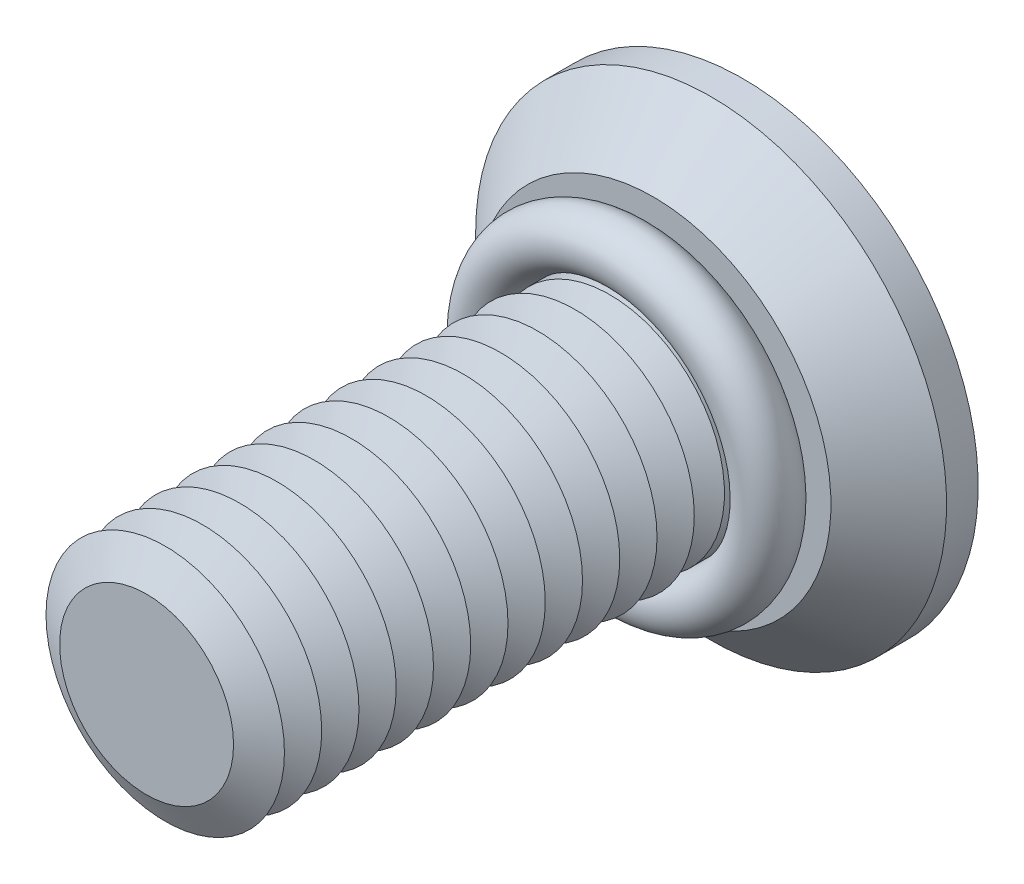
ISO-10303-21;
HEADER;
FILE_DESCRIPTION(('STEP AP214'),'2;1');
FILE_NAME('part.step','',(''),(''),'','','');
FILE_SCHEMA(('AUTOMOTIVE_DESIGN { 1 0 10303 214 1 1 1 1 }'));
ENDSEC;
DATA;
#1=APPLICATION_CONTEXT('core data for automotive mechanical design processes');
#2=APPLICATION_PROTOCOL_DEFINITION('international standard','automotive_design',2000,#1);
#3=PRODUCT_CONTEXT('',#1,'mechanical');
#4=PRODUCT('Part','Part','',(#3));
#5=PRODUCT_RELATED_PRODUCT_CATEGORY('part','',(#4));
#6=PRODUCT_DEFINITION_FORMATION('','',#4);
#7=PRODUCT_DEFINITION_CONTEXT('part definition',#1,'design');
#8=PRODUCT_DEFINITION('design','',#6,#7);
#9=PRODUCT_DEFINITION_SHAPE('','',#8);
#10=(LENGTH_UNIT() NAMED_UNIT(*) SI_UNIT(.MILLI.,.METRE.));
#11=(NAMED_UNIT(*) PLANE_ANGLE_UNIT() SI_UNIT($,.RADIAN.));
#12=(NAMED_UNIT(*) SI_UNIT($,.STERADIAN.) SOLID_ANGLE_UNIT());
#13=UNCERTAINTY_MEASURE_WITH_UNIT(LENGTH_MEASURE(1.E-05),#10,'distance_accuracy_value','');
#14=(GEOMETRIC_REPRESENTATION_CONTEXT(3) GLOBAL_UNCERTAINTY_ASSIGNED_CONTEXT((#13)) GLOBAL_UNIT_ASSIGNED_CONTEXT((#10,
#11,#12)) REPRESENTATION_CONTEXT('',''));
#15=CARTESIAN_POINT('',(0.,0.,0.));
#16=DIRECTION('',(0.,0.,1.));
#17=DIRECTION('',(1.,0.,0.));
#18=AXIS2_PLACEMENT_3D('',#15,#16,#17);
#19=CARTESIAN_POINT('',(0.,0.,3.9));
#20=DIRECTION('',(0.,0.,1.));
#21=DIRECTION('',(1.,0.,0.));
#22=AXIS2_PLACEMENT_3D('',#19,#20,#21);
#23=TOROIDAL_SURFACE('',#22,4.75,0.9);
#24=CARTESIAN_POINT('',(0.,4.75,3.9));
#25=DIRECTION('',(1.,0.,0.));
#26=DIRECTION('',(0.,0.,-1.));
#27=AXIS2_PLACEMENT_3D('',#24,#25,#26);
#28=CIRCLE('',#27,0.9);
#29=CARTESIAN_POINT('',(0.,5.65,3.9));
#30=VERTEX_POINT('',#29);
#31=EDGE_CURVE('P0_E10',#30,#30,#28,.T.);
#32=CARTESIAN_POINT('',(0.,0.,3.9));
#33=DIRECTION('',(0.,0.,1.));
#34=DIRECTION('',(1.,0.,0.));
#35=AXIS2_PLACEMENT_3D('',#32,#33,#34);
#36=CIRCLE('',#35,5.65);
#37=EDGE_CURVE('',#30,#30,#36,.T.);
#38=ORIENTED_EDGE('',*,*,#31,.F.);
#39=ORIENTED_EDGE('',*,*,#31,.T.);
#40=ORIENTED_EDGE('',*,*,#37,.T.);
#41=ORIENTED_EDGE('',*,*,#37,.F.);
#42=EDGE_LOOP('',(#38,#40,#39,#41));
#43=FACE_BOUND('',#42,.T.);
#44=ADVANCED_FACE('P0_F14',(#43),#23,.T.);
#45=CLOSED_SHELL('',(#44));
#46=MANIFOLD_SOLID_BREP('P0_B1',#45);
#47=CARTESIAN_POINT('',(0.,0.,13.75));
#48=DIRECTION('',(0.,0.,-1.));
#49=DIRECTION('',(-1.,0.,0.));
#50=AXIS2_PLACEMENT_3D('',#47,#48,#49);
#51=CONICAL_SURFACE('',#50,2.91746824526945,1.0471975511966);
#52=CARTESIAN_POINT('',(0.,0.,13.125));
#53=DIRECTION('',(0.,0.,1.));
#54=DIRECTION('',(1.,0.,0.));
#55=AXIS2_PLACEMENT_3D('',#52,#53,#54);
#56=CIRCLE('',#55,4.);
#57=CARTESIAN_POINT('',(4.,0.,13.125));
#58=VERTEX_POINT('',#57);
#59=EDGE_CURVE('P1_E324',#58,#58,#56,.T.);
#60=ORIENTED_EDGE('',*,*,#59,.T.);
#61=EDGE_LOOP('',(#60));
#62=FACE_BOUND('',#61,.T.);
#63=CARTESIAN_POINT('',(0.,0.,13.75));
#64=DIRECTION('',(0.,0.,1.));
#65=DIRECTION('',(1.,0.,0.));
#66=AXIS2_PLACEMENT_3D('',#63,#64,#65);
#67=CIRCLE('',#66,2.91746824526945);
#68=CARTESIAN_POINT('',(2.91746824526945,0.,13.75));
#69=VERTEX_POINT('',#68);
#70=EDGE_CURVE('P1_E321',#69,#69,#67,.T.);
#71=ORIENTED_EDGE('',*,*,#70,.F.);
#72=EDGE_LOOP('',(#71));
#73=FACE_BOUND('',#72,.T.);
#74=ADVANCED_FACE('P1_F15',(#62,#73),#51,.T.);
#75=CARTESIAN_POINT('',(0.,0.,14.375));
#76=DIRECTION('',(0.,0.,1.));
#77=DIRECTION('',(1.,0.,0.));
#78=AXIS2_PLACEMENT_3D('',#75,#76,#77);
#79=CONICAL_SURFACE('',#78,4.,1.0471975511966);
#80=ORIENTED_EDGE('',*,*,#70,.T.);
#81=EDGE_LOOP('',(#80));
#82=FACE_BOUND('',#81,.T.);
#83=CARTESIAN_POINT('',(0.,0.,14.375));
#84=DIRECTION('',(0.,0.,1.));
#85=DIRECTION('',(1.,0.,0.));
#86=AXIS2_PLACEMENT_3D('',#83,#84,#85);
#87=CIRCLE('',#86,4.);
#88=CARTESIAN_POINT('',(4.,0.,14.375));
#89=VERTEX_POINT('',#88);
#90=EDGE_CURVE('P1_E318',#89,#89,#87,.T.);
#91=ORIENTED_EDGE('',*,*,#90,.F.);
#92=EDGE_LOOP('',(#91));
#93=FACE_BOUND('',#92,.T.);
#94=ADVANCED_FACE('P1_F245',(#82,#93),#79,.T.);
#95=CARTESIAN_POINT('',(0.,0.,20.));
#96=DIRECTION('',(0.,0.,1.));
#97=DIRECTION('',(1.,0.,0.));
#98=AXIS2_PLACEMENT_3D('',#95,#96,#97);
#99=PLANE('',#98);
#100=CARTESIAN_POINT('',(0.,0.,20.));
#101=DIRECTION('',(0.,0.,1.));
#102=DIRECTION('',(1.,0.,0.));
#103=AXIS2_PLACEMENT_3D('',#100,#101,#102);
#104=CIRCLE('',#103,2.91746824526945);
#105=CARTESIAN_POINT('',(2.91746824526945,0.,20.));
#106=VERTEX_POINT('',#105);
#107=EDGE_CURVE('P1_E131',#106,#106,#104,.T.);
#108=ORIENTED_EDGE('',*,*,#107,.T.);
#109=EDGE_LOOP('',(#108));
#110=FACE_BOUND('',#109,.T.);
#111=ADVANCED_FACE('P1_F251',(#110),#99,.T.);
#112=CARTESIAN_POINT('',(0.,0.,20.));
#113=DIRECTION('',(0.,0.,-1.));
#114=DIRECTION('',(-1.,0.,0.));
#115=AXIS2_PLACEMENT_3D('',#112,#113,#114);
#116=CONICAL_SURFACE('',#115,2.91746824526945,1.0471975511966);
#117=CARTESIAN_POINT('',(0.,0.,19.375));
#118=DIRECTION('',(0.,0.,1.));
#119=DIRECTION('',(1.,0.,0.));
#120=AXIS2_PLACEMENT_3D('',#117,#118,#119);
#121=CIRCLE('',#120,4.);
#122=CARTESIAN_POINT('',(4.,0.,19.375));
#123=VERTEX_POINT('',#122);
#124=EDGE_CURVE('P1_E133',#123,#123,#121,.T.);
#125=ORIENTED_EDGE('',*,*,#124,.T.);
#126=EDGE_LOOP('',(#125));
#127=FACE_BOUND('',#126,.T.);
#128=ORIENTED_EDGE('',*,*,#107,.F.);
#129=EDGE_LOOP('',(#128));
#130=FACE_BOUND('',#129,.T.);
#131=ADVANCED_FACE('P1_F196',(#127,#130),#116,.T.);
#132=CARTESIAN_POINT('',(0.,0.,19.375));
#133=DIRECTION('',(0.,0.,1.));
#134=DIRECTION('',(1.,0.,0.));
#135=AXIS2_PLACEMENT_3D('',#132,#133,#134);
#136=CONICAL_SURFACE('',#135,4.,1.0471975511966);
#137=CARTESIAN_POINT('',(0.,0.,18.75));
#138=DIRECTION('',(0.,0.,1.));
#139=DIRECTION('',(1.,0.,0.));
#140=AXIS2_PLACEMENT_3D('',#137,#138,#139);
#141=CIRCLE('',#140,2.91746824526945);
#142=CARTESIAN_POINT('',(2.91746824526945,0.,18.75));
#143=VERTEX_POINT('',#142);
#144=EDGE_CURVE('P1_E297',#143,#143,#141,.T.);
#145=ORIENTED_EDGE('',*,*,#144,.T.);
#146=EDGE_LOOP('',(#145));
#147=FACE_BOUND('',#146,.T.);
#148=ORIENTED_EDGE('',*,*,#124,.F.);
#149=EDGE_LOOP('',(#148));
#150=FACE_BOUND('',#149,.T.);
#151=ADVANCED_FACE('P1_F284',(#147,#150),#136,.T.);
#152=CARTESIAN_POINT('',(0.,0.,18.75));
#153=DIRECTION('',(0.,0.,-1.));
#154=DIRECTION('',(-1.,0.,0.));
#155=AXIS2_PLACEMENT_3D('',#152,#153,#154);
#156=CONICAL_SURFACE('',#155,2.91746824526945,1.0471975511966);
#157=CARTESIAN_POINT('',(0.,0.,18.125));
#158=DIRECTION('',(0.,0.,1.));
#159=DIRECTION('',(1.,0.,0.));
#160=AXIS2_PLACEMENT_3D('',#157,#158,#159);
#161=CIRCLE('',#160,4.);
#162=CARTESIAN_POINT('',(4.,0.,18.125));
#163=VERTEX_POINT('',#162);
#164=EDGE_CURVE('P1_E294',#163,#163,#161,.T.);
#165=ORIENTED_EDGE('',*,*,#164,.T.);
#166=EDGE_LOOP('',(#165));
#167=FACE_BOUND('',#166,.T.);
#168=ORIENTED_EDGE('',*,*,#144,.F.);
#169=EDGE_LOOP('',(#168));
#170=FACE_BOUND('',#169,.T.);
#171=ADVANCED_FACE('P1_F279',(#167,#170),#156,.T.);
#172=CARTESIAN_POINT('',(0.,0.,18.125));
#173=DIRECTION('',(0.,0.,1.));
#174=DIRECTION('',(1.,0.,0.));
#175=AXIS2_PLACEMENT_3D('',#172,#173,#174);
#176=CONICAL_SURFACE('',#175,4.,1.0471975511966);
#177=CARTESIAN_POINT('',(0.,0.,17.5));
#178=DIRECTION('',(0.,0.,1.));
#179=DIRECTION('',(1.,0.,0.));
#180=AXIS2_PLACEMENT_3D('',#177,#178,#179);
#181=CIRCLE('',#180,2.91746824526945);
#182=CARTESIAN_POINT('',(2.91746824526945,0.,17.5));
#183=VERTEX_POINT('',#182);
#184=EDGE_CURVE('P1_E301',#183,#183,#181,.T.);
#185=ORIENTED_EDGE('',*,*,#184,.T.);
#186=EDGE_LOOP('',(#185));
#187=FACE_BOUND('',#186,.T.);
#188=ORIENTED_EDGE('',*,*,#164,.F.);
#189=EDGE_LOOP('',(#188));
#190=FACE_BOUND('',#189,.T.);
#191=ADVANCED_FACE('P1_F276',(#187,#190),#176,.T.);
#192=CARTESIAN_POINT('',(0.,0.,17.5));
#193=DIRECTION('',(0.,0.,-1.));
#194=DIRECTION('',(-1.,0.,0.));
#195=AXIS2_PLACEMENT_3D('',#192,#193,#194);
#196=CONICAL_SURFACE('',#195,2.91746824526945,1.0471975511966);
#197=CARTESIAN_POINT('',(0.,0.,16.875));
#198=DIRECTION('',(0.,0.,1.));
#199=DIRECTION('',(1.,0.,0.));
#200=AXIS2_PLACEMENT_3D('',#197,#198,#199);
#201=CIRCLE('',#200,4.);
#202=CARTESIAN_POINT('',(4.,0.,16.875));
#203=VERTEX_POINT('',#202);
#204=EDGE_CURVE('P1_E306',#203,#203,#201,.T.);
#205=ORIENTED_EDGE('',*,*,#204,.T.);
#206=EDGE_LOOP('',(#205));
#207=FACE_BOUND('',#206,.T.);
#208=ORIENTED_EDGE('',*,*,#184,.F.);
#209=EDGE_LOOP('',(#208));
#210=FACE_BOUND('',#209,.T.);
#211=ADVANCED_FACE('P1_F271',(#207,#210),#196,.T.);
#212=CARTESIAN_POINT('',(0.,0.,16.875));
#213=DIRECTION('',(0.,0.,1.));
#214=DIRECTION('',(1.,0.,0.));
#215=AXIS2_PLACEMENT_3D('',#212,#213,#214);
#216=CONICAL_SURFACE('',#215,4.,1.0471975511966);
#217=CARTESIAN_POINT('',(0.,0.,16.25));
#218=DIRECTION('',(0.,0.,1.));
#219=DIRECTION('',(1.,0.,0.));
#220=AXIS2_PLACEMENT_3D('',#217,#218,#219);
#221=CIRCLE('',#220,2.91746824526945);
#222=CARTESIAN_POINT('',(2.91746824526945,0.,16.25));
#223=VERTEX_POINT('',#222);
#224=EDGE_CURVE('P1_E309',#223,#223,#221,.T.);
#225=ORIENTED_EDGE('',*,*,#224,.T.);
#226=EDGE_LOOP('',(#225));
#227=FACE_BOUND('',#226,.T.);
#228=ORIENTED_EDGE('',*,*,#204,.F.);
#229=EDGE_LOOP('',(#228));
#230=FACE_BOUND('',#229,.T.);
#231=ADVANCED_FACE('P1_F268',(#227,#230),#216,.T.);
#232=CARTESIAN_POINT('',(0.,0.,16.25));
#233=DIRECTION('',(0.,0.,-1.));
#234=DIRECTION('',(-1.,0.,0.));
#235=AXIS2_PLACEMENT_3D('',#232,#233,#234);
#236=CONICAL_SURFACE('',#235,2.91746824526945,1.0471975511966);
#237=CARTESIAN_POINT('',(0.,0.,15.625));
#238=DIRECTION('',(0.,0.,1.));
#239=DIRECTION('',(1.,0.,0.));
#240=AXIS2_PLACEMENT_3D('',#237,#238,#239);
#241=CIRCLE('',#240,4.);
#242=CARTESIAN_POINT('',(4.,0.,15.625));
#243=VERTEX_POINT('',#242);
#244=EDGE_CURVE('P1_E312',#243,#243,#241,.T.);
#245=ORIENTED_EDGE('',*,*,#244,.T.);
#246=EDGE_LOOP('',(#245));
#247=FACE_BOUND('',#246,.T.);
#248=ORIENTED_EDGE('',*,*,#224,.F.);
#249=EDGE_LOOP('',(#248));
#250=FACE_BOUND('',#249,.T.);
#251=ADVANCED_FACE('P1_F262',(#247,#250),#236,.T.);
#252=CARTESIAN_POINT('',(0.,0.,15.625));
#253=DIRECTION('',(0.,0.,1.));
#254=DIRECTION('',(1.,0.,0.));
#255=AXIS2_PLACEMENT_3D('',#252,#253,#254);
#256=CONICAL_SURFACE('',#255,4.,1.0471975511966);
#257=CARTESIAN_POINT('',(0.,0.,15.));
#258=DIRECTION('',(0.,0.,1.));
#259=DIRECTION('',(1.,0.,0.));
#260=AXIS2_PLACEMENT_3D('',#257,#258,#259);
#261=CIRCLE('',#260,2.91746824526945);
#262=CARTESIAN_POINT('',(2.91746824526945,0.,15.));
#263=VERTEX_POINT('',#262);
#264=EDGE_CURVE('P1_E315',#263,#263,#261,.T.);
#265=ORIENTED_EDGE('',*,*,#264,.T.);
#266=EDGE_LOOP('',(#265));
#267=FACE_BOUND('',#266,.T.);
#268=ORIENTED_EDGE('',*,*,#244,.F.);
#269=EDGE_LOOP('',(#268));
#270=FACE_BOUND('',#269,.T.);
#271=ADVANCED_FACE('P1_F258',(#267,#270),#256,.T.);
#272=CARTESIAN_POINT('',(0.,0.,15.));
#273=DIRECTION('',(0.,0.,-1.));
#274=DIRECTION('',(-1.,0.,0.));
#275=AXIS2_PLACEMENT_3D('',#272,#273,#274);
#276=CONICAL_SURFACE('',#275,2.91746824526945,1.0471975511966);
#277=ORIENTED_EDGE('',*,*,#90,.T.);
#278=EDGE_LOOP('',(#277));
#279=FACE_BOUND('',#278,.T.);
#280=ORIENTED_EDGE('',*,*,#264,.F.);
#281=EDGE_LOOP('',(#280));
#282=FACE_BOUND('',#281,.T.);
#283=ADVANCED_FACE('P1_F261',(#279,#282),#276,.T.);
#284=CARTESIAN_POINT('',(0.,0.,12.5));
#285=DIRECTION('',(0.,0.,-1.));
#286=DIRECTION('',(-1.,0.,0.));
#287=AXIS2_PLACEMENT_3D('',#284,#285,#286);
#288=CONICAL_SURFACE('',#287,2.91746824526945,1.0471975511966);
#289=CARTESIAN_POINT('',(0.,0.,11.875));
#290=DIRECTION('',(0.,0.,1.));
#291=DIRECTION('',(1.,0.,0.));
#292=AXIS2_PLACEMENT_3D('',#289,#290,#291);
#293=CIRCLE('',#292,4.);
#294=CARTESIAN_POINT('',(4.,0.,11.875));
#295=VERTEX_POINT('',#294);
#296=EDGE_CURVE('P1_E329',#295,#295,#293,.T.);
#297=ORIENTED_EDGE('',*,*,#296,.T.);
#298=EDGE_LOOP('',(#297));
#299=FACE_BOUND('',#298,.T.);
#300=CARTESIAN_POINT('',(0.,0.,12.5));
#301=DIRECTION('',(0.,0.,1.));
#302=DIRECTION('',(1.,0.,0.));
#303=AXIS2_PLACEMENT_3D('',#300,#301,#302);
#304=CIRCLE('',#303,2.91746824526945);
#305=CARTESIAN_POINT('',(2.91746824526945,0.,12.5));
#306=VERTEX_POINT('',#305);
#307=EDGE_CURVE('P1_E326',#306,#306,#304,.T.);
#308=ORIENTED_EDGE('',*,*,#307,.F.);
#309=EDGE_LOOP('',(#308));
#310=FACE_BOUND('',#309,.T.);
#311=ADVANCED_FACE('P1_F266',(#299,#310),#288,.T.);
#312=CARTESIAN_POINT('',(0.,0.,13.125));
#313=DIRECTION('',(0.,0.,1.));
#314=DIRECTION('',(1.,0.,0.));
#315=AXIS2_PLACEMENT_3D('',#312,#313,#314);
#316=CONICAL_SURFACE('',#315,4.,1.0471975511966);
#317=ORIENTED_EDGE('',*,*,#307,.T.);
#318=EDGE_LOOP('',(#317));
#319=FACE_BOUND('',#318,.T.);
#320=ORIENTED_EDGE('',*,*,#59,.F.);
#321=EDGE_LOOP('',(#320));
#322=FACE_BOUND('',#321,.T.);
#323=ADVANCED_FACE('P1_F467',(#319,#322),#316,.T.);
#324=CARTESIAN_POINT('',(0.,0.,11.25));
#325=DIRECTION('',(0.,0.,-1.));
#326=DIRECTION('',(-1.,0.,0.));
#327=AXIS2_PLACEMENT_3D('',#324,#325,#326);
#328=CONICAL_SURFACE('',#327,2.91746824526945,1.0471975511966);
#329=CARTESIAN_POINT('',(0.,0.,10.625));
#330=DIRECTION('',(0.,0.,1.));
#331=DIRECTION('',(1.,0.,0.));
#332=AXIS2_PLACEMENT_3D('',#329,#330,#331);
#333=CIRCLE('',#332,4.);
#334=CARTESIAN_POINT('',(4.,0.,10.625));
#335=VERTEX_POINT('',#334);
#336=EDGE_CURVE('P1_E335',#335,#335,#333,.T.);
#337=ORIENTED_EDGE('',*,*,#336,.T.);
#338=EDGE_LOOP('',(#337));
#339=FACE_BOUND('',#338,.T.);
#340=CARTESIAN_POINT('',(0.,0.,11.25));
#341=DIRECTION('',(0.,0.,1.));
#342=DIRECTION('',(1.,0.,0.));
#343=AXIS2_PLACEMENT_3D('',#340,#341,#342);
#344=CIRCLE('',#343,2.91746824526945);
#345=CARTESIAN_POINT('',(2.91746824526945,0.,11.25));
#346=VERTEX_POINT('',#345);
#347=EDGE_CURVE('P1_E332',#346,#346,#344,.T.);
#348=ORIENTED_EDGE('',*,*,#347,.F.);
#349=EDGE_LOOP('',(#348));
#350=FACE_BOUND('',#349,.T.);
#351=ADVANCED_FACE('P1_F476',(#339,#350),#328,.T.);
#352=CARTESIAN_POINT('',(0.,0.,11.875));
#353=DIRECTION('',(0.,0.,1.));
#354=DIRECTION('',(1.,0.,0.));
#355=AXIS2_PLACEMENT_3D('',#352,#353,#354);
#356=CONICAL_SURFACE('',#355,4.,1.0471975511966);
#357=ORIENTED_EDGE('',*,*,#347,.T.);
#358=EDGE_LOOP('',(#357));
#359=FACE_BOUND('',#358,.T.);
#360=ORIENTED_EDGE('',*,*,#296,.F.);
#361=EDGE_LOOP('',(#360));
#362=FACE_BOUND('',#361,.T.);
#363=ADVANCED_FACE('P1_F486',(#359,#362),#356,.T.);
#364=CARTESIAN_POINT('',(0.,0.,10.));
#365=DIRECTION('',(0.,0.,-1.));
#366=DIRECTION('',(-1.,0.,0.));
#367=AXIS2_PLACEMENT_3D('',#364,#365,#366);
#368=CONICAL_SURFACE('',#367,2.91746824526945,1.0471975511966);
#369=CARTESIAN_POINT('',(0.,0.,9.375));
#370=DIRECTION('',(0.,0.,1.));
#371=DIRECTION('',(1.,0.,0.));
#372=AXIS2_PLACEMENT_3D('',#369,#370,#371);
#373=CIRCLE('',#372,4.);
#374=CARTESIAN_POINT('',(4.,0.,9.375));
#375=VERTEX_POINT('',#374);
#376=EDGE_CURVE('P1_E341',#375,#375,#373,.T.);
#377=ORIENTED_EDGE('',*,*,#376,.T.);
#378=EDGE_LOOP('',(#377));
#379=FACE_BOUND('',#378,.T.);
#380=CARTESIAN_POINT('',(0.,0.,10.));
#381=DIRECTION('',(0.,0.,1.));
#382=DIRECTION('',(1.,0.,0.));
#383=AXIS2_PLACEMENT_3D('',#380,#381,#382);
#384=CIRCLE('',#383,2.91746824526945);
#385=CARTESIAN_POINT('',(2.91746824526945,0.,10.));
#386=VERTEX_POINT('',#385);
#387=EDGE_CURVE('P1_E338',#386,#386,#384,.T.);
#388=ORIENTED_EDGE('',*,*,#387,.F.);
#389=EDGE_LOOP('',(#388));
#390=FACE_BOUND('',#389,.T.);
#391=ADVANCED_FACE('P1_F496',(#379,#390),#368,.T.);
#392=CARTESIAN_POINT('',(0.,0.,10.625));
#393=DIRECTION('',(0.,0.,1.));
#394=DIRECTION('',(1.,0.,0.));
#395=AXIS2_PLACEMENT_3D('',#392,#393,#394);
#396=CONICAL_SURFACE('',#395,4.,1.0471975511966);
#397=ORIENTED_EDGE('',*,*,#387,.T.);
#398=EDGE_LOOP('',(#397));
#399=FACE_BOUND('',#398,.T.);
#400=ORIENTED_EDGE('',*,*,#336,.F.);
#401=EDGE_LOOP('',(#400));
#402=FACE_BOUND('',#401,.T.);
#403=ADVANCED_FACE('P1_F506',(#399,#402),#396,.T.);
#404=CARTESIAN_POINT('',(0.,0.,8.75));
#405=DIRECTION('',(0.,0.,-1.));
#406=DIRECTION('',(-1.,0.,0.));
#407=AXIS2_PLACEMENT_3D('',#404,#405,#406);
#408=CONICAL_SURFACE('',#407,2.91746824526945,1.0471975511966);
#409=CARTESIAN_POINT('',(0.,0.,8.125));
#410=DIRECTION('',(0.,0.,1.));
#411=DIRECTION('',(1.,0.,0.));
#412=AXIS2_PLACEMENT_3D('',#409,#410,#411);
#413=CIRCLE('',#412,4.);
#414=CARTESIAN_POINT('',(4.,0.,8.125));
#415=VERTEX_POINT('',#414);
#416=EDGE_CURVE('P1_E347',#415,#415,#413,.T.);
#417=ORIENTED_EDGE('',*,*,#416,.T.);
#418=EDGE_LOOP('',(#417));
#419=FACE_BOUND('',#418,.T.);
#420=CARTESIAN_POINT('',(0.,0.,8.75));
#421=DIRECTION('',(0.,0.,1.));
#422=DIRECTION('',(1.,0.,0.));
#423=AXIS2_PLACEMENT_3D('',#420,#421,#422);
#424=CIRCLE('',#423,2.91746824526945);
#425=CARTESIAN_POINT('',(2.91746824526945,0.,8.75));
#426=VERTEX_POINT('',#425);
#427=EDGE_CURVE('P1_E344',#426,#426,#424,.T.);
#428=ORIENTED_EDGE('',*,*,#427,.F.);
#429=EDGE_LOOP('',(#428));
#430=FACE_BOUND('',#429,.T.);
#431=ADVANCED_FACE('P1_F516',(#419,#430),#408,.T.);
#432=CARTESIAN_POINT('',(0.,0.,9.375));
#433=DIRECTION('',(0.,0.,1.));
#434=DIRECTION('',(1.,0.,0.));
#435=AXIS2_PLACEMENT_3D('',#432,#433,#434);
#436=CONICAL_SURFACE('',#435,4.,1.0471975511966);
#437=ORIENTED_EDGE('',*,*,#427,.T.);
#438=EDGE_LOOP('',(#437));
#439=FACE_BOUND('',#438,.T.);
#440=ORIENTED_EDGE('',*,*,#376,.F.);
#441=EDGE_LOOP('',(#440));
#442=FACE_BOUND('',#441,.T.);
#443=ADVANCED_FACE('P1_F526',(#439,#442),#436,.T.);
#444=CARTESIAN_POINT('',(0.,0.,7.5));
#445=DIRECTION('',(0.,0.,-1.));
#446=DIRECTION('',(-1.,0.,0.));
#447=AXIS2_PLACEMENT_3D('',#444,#445,#446);
#448=CONICAL_SURFACE('',#447,2.91746824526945,1.0471975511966);
#449=CARTESIAN_POINT('',(0.,0.,6.875));
#450=DIRECTION('',(0.,0.,1.));
#451=DIRECTION('',(1.,0.,0.));
#452=AXIS2_PLACEMENT_3D('',#449,#450,#451);
#453=CIRCLE('',#452,4.);
#454=CARTESIAN_POINT('',(4.,0.,6.875));
#455=VERTEX_POINT('',#454);
#456=EDGE_CURVE('P1_E353',#455,#455,#453,.T.);
#457=ORIENTED_EDGE('',*,*,#456,.T.);
#458=EDGE_LOOP('',(#457));
#459=FACE_BOUND('',#458,.T.);
#460=CARTESIAN_POINT('',(0.,0.,7.5));
#461=DIRECTION('',(0.,0.,1.));
#462=DIRECTION('',(1.,0.,0.));
#463=AXIS2_PLACEMENT_3D('',#460,#461,#462);
#464=CIRCLE('',#463,2.91746824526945);
#465=CARTESIAN_POINT('',(2.91746824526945,0.,7.5));
#466=VERTEX_POINT('',#465);
#467=EDGE_CURVE('P1_E350',#466,#466,#464,.T.);
#468=ORIENTED_EDGE('',*,*,#467,.F.);
#469=EDGE_LOOP('',(#468));
#470=FACE_BOUND('',#469,.T.);
#471=ADVANCED_FACE('P1_F536',(#459,#470),#448,.T.);
#472=CARTESIAN_POINT('',(0.,0.,8.125));
#473=DIRECTION('',(0.,0.,1.));
#474=DIRECTION('',(1.,0.,0.));
#475=AXIS2_PLACEMENT_3D('',#472,#473,#474);
#476=CONICAL_SURFACE('',#475,4.,1.0471975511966);
#477=ORIENTED_EDGE('',*,*,#467,.T.);
#478=EDGE_LOOP('',(#477));
#479=FACE_BOUND('',#478,.T.);
#480=ORIENTED_EDGE('',*,*,#416,.F.);
#481=EDGE_LOOP('',(#480));
#482=FACE_BOUND('',#481,.T.);
#483=ADVANCED_FACE('P1_F546',(#479,#482),#476,.T.);
#484=CARTESIAN_POINT('',(0.,0.,6.25));
#485=DIRECTION('',(0.,0.,-1.));
#486=DIRECTION('',(-1.,0.,0.));
#487=AXIS2_PLACEMENT_3D('',#484,#485,#486);
#488=CONICAL_SURFACE('',#487,2.91746824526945,1.0471975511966);
#489=CARTESIAN_POINT('',(0.,0.,5.625));
#490=DIRECTION('',(0.,0.,1.));
#491=DIRECTION('',(1.,0.,0.));
#492=AXIS2_PLACEMENT_3D('',#489,#490,#491);
#493=CIRCLE('',#492,4.);
#494=CARTESIAN_POINT('',(4.,0.,5.625));
#495=VERTEX_POINT('',#494);
#496=EDGE_CURVE('P1_E359',#495,#495,#493,.T.);
#497=ORIENTED_EDGE('',*,*,#496,.T.);
#498=EDGE_LOOP('',(#497));
#499=FACE_BOUND('',#498,.T.);
#500=CARTESIAN_POINT('',(0.,0.,6.25));
#501=DIRECTION('',(0.,0.,1.));
#502=DIRECTION('',(1.,0.,0.));
#503=AXIS2_PLACEMENT_3D('',#500,#501,#502);
#504=CIRCLE('',#503,2.91746824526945);
#505=CARTESIAN_POINT('',(2.91746824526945,0.,6.25));
#506=VERTEX_POINT('',#505);
#507=EDGE_CURVE('P1_E356',#506,#506,#504,.T.);
#508=ORIENTED_EDGE('',*,*,#507,.F.);
#509=EDGE_LOOP('',(#508));
#510=FACE_BOUND('',#509,.T.);
#511=ADVANCED_FACE('P1_F556',(#499,#510),#488,.T.);
#512=CARTESIAN_POINT('',(0.,0.,6.875));
#513=DIRECTION('',(0.,0.,1.));
#514=DIRECTION('',(1.,0.,0.));
#515=AXIS2_PLACEMENT_3D('',#512,#513,#514);
#516=CONICAL_SURFACE('',#515,4.,1.0471975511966);
#517=ORIENTED_EDGE('',*,*,#507,.T.);
#518=EDGE_LOOP('',(#517));
#519=FACE_BOUND('',#518,.T.);
#520=ORIENTED_EDGE('',*,*,#456,.F.);
#521=EDGE_LOOP('',(#520));
#522=FACE_BOUND('',#521,.T.);
#523=ADVANCED_FACE('P1_F372',(#519,#522),#516,.T.);
#524=CARTESIAN_POINT('',(0.,0.,5.));
#525=DIRECTION('',(0.,0.,-1.));
#526=DIRECTION('',(-1.,0.,0.));
#527=AXIS2_PLACEMENT_3D('',#524,#525,#526);
#528=CONICAL_SURFACE('',#527,2.91746824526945,1.0471975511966);
#529=CARTESIAN_POINT('',(0.,0.,5.));
#530=DIRECTION('',(0.,0.,1.));
#531=DIRECTION('',(1.,0.,0.));
#532=AXIS2_PLACEMENT_3D('',#529,#530,#531);
#533=CIRCLE('',#532,2.91746824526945);
#534=CARTESIAN_POINT('',(2.91746824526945,0.,5.));
#535=VERTEX_POINT('',#534);
#536=EDGE_CURVE('P1_E362',#535,#535,#533,.T.);
#537=ORIENTED_EDGE('',*,*,#536,.F.);
#538=EDGE_LOOP('',(#537));
#539=FACE_BOUND('',#538,.T.);
#540=CARTESIAN_POINT('',(0.,0.,4.46160254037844));
#541=DIRECTION('',(0.,0.,-1.));
#542=DIRECTION('',(-1.,0.,0.));
#543=AXIS2_PLACEMENT_3D('',#540,#541,#542);
#544=CIRCLE('',#543,3.85);
#545=CARTESIAN_POINT('',(-3.85,0.,4.46160254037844));
#546=VERTEX_POINT('',#545);
#547=EDGE_CURVE('P1_E19',#546,#546,#544,.F.);
#548=ORIENTED_EDGE('',*,*,#547,.T.);
#549=EDGE_LOOP('',(#548));
#550=FACE_BOUND('',#549,.T.);
#551=ADVANCED_FACE('P1_F369',(#539,#550),#528,.T.);
#552=CARTESIAN_POINT('',(0.,0.,5.625));
#553=DIRECTION('',(0.,0.,1.));
#554=DIRECTION('',(1.,0.,0.));
#555=AXIS2_PLACEMENT_3D('',#552,#553,#554);
#556=CONICAL_SURFACE('',#555,4.,1.0471975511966);
#557=ORIENTED_EDGE('',*,*,#536,.T.);
#558=EDGE_LOOP('',(#557));
#559=FACE_BOUND('',#558,.T.);
#560=ORIENTED_EDGE('',*,*,#496,.F.);
#561=EDGE_LOOP('',(#560));
#562=FACE_BOUND('',#561,.T.);
#563=ADVANCED_FACE('P1_F366',(#559,#562),#556,.T.);
#564=CARTESIAN_POINT('',(0.,0.,3.));
#565=DIRECTION('',(0.,0.,-1.));
#566=DIRECTION('',(-1.,0.,0.));
#567=AXIS2_PLACEMENT_3D('',#564,#565,#566);
#568=CONICAL_SURFACE('',#567,2.5,1.0471975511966);
#569=CARTESIAN_POINT('',(0.,0.,4.44337567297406));
#570=VERTEX_POINT('',#569);
#571=VERTEX_LOOP('',#570);
#572=FACE_BOUND('',#571,.T.);
#573=CARTESIAN_POINT('',(0.,0.,3.));
#574=DIRECTION('',(0.,0.,-1.));
#575=DIRECTION('',(-1.,0.,0.));
#576=AXIS2_PLACEMENT_3D('',#573,#574,#575);
#577=CIRCLE('',#576,2.5);
#578=CARTESIAN_POINT('',(-2.5,0.,3.));
#579=VERTEX_POINT('',#578);
#580=CARTESIAN_POINT('',(-1.25,2.1650635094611,3.));
#581=VERTEX_POINT('',#580);
#582=EDGE_CURVE('P1_E117',#579,#581,#577,.T.);
#583=ORIENTED_EDGE('',*,*,#582,.T.);
#584=CARTESIAN_POINT('',(0.,0.,3.));
#585=DIRECTION('',(0.,0.,-1.));
#586=DIRECTION('',(-1.,0.,0.));
#587=AXIS2_PLACEMENT_3D('',#584,#585,#586);
#588=CIRCLE('',#587,2.5);
#589=CARTESIAN_POINT('',(1.25,2.1650635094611,3.));
#590=VERTEX_POINT('',#589);
#591=EDGE_CURVE('P1_E24',#581,#590,#588,.T.);
#592=ORIENTED_EDGE('',*,*,#591,.T.);
#593=CARTESIAN_POINT('',(2.5,0.,3.));
#594=VERTEX_POINT('',#593);
#595=EDGE_CURVE('P1_E791',#590,#594,#588,.T.);
#596=ORIENTED_EDGE('',*,*,#595,.T.);
#597=CARTESIAN_POINT('',(1.25,-2.1650635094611,3.));
#598=VERTEX_POINT('',#597);
#599=EDGE_CURVE('P1_E784',#594,#598,#588,.T.);
#600=ORIENTED_EDGE('',*,*,#599,.T.);
#601=CARTESIAN_POINT('',(-1.25,-2.1650635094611,3.));
#602=VERTEX_POINT('',#601);
#603=EDGE_CURVE('P1_E182',#598,#602,#588,.T.);
#604=ORIENTED_EDGE('',*,*,#603,.T.);
#605=EDGE_CURVE('P1_E179',#602,#579,#588,.T.);
#606=ORIENTED_EDGE('',*,*,#605,.T.);
#607=EDGE_LOOP('',(#583,#592,#596,#600,#604,#606));
#608=FACE_BOUND('',#607,.T.);
#609=ADVANCED_FACE('P1_F198',(#572,#608),#568,.F.);
#610=CARTESIAN_POINT('',(0.,0.,3.));
#611=DIRECTION('',(0.,0.,-1.));
#612=DIRECTION('',(-1.,0.,0.));
#613=AXIS2_PLACEMENT_3D('',#610,#611,#612);
#614=PLANE('',#613);
#615=ORIENTED_EDGE('',*,*,#603,.F.);
#616=DIRECTION('',(-0.866025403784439,-0.5,0.));
#617=VECTOR('',#616,1.);
#618=CARTESIAN_POINT('',(2.5,-1.44337567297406,3.));
#619=LINE('',#618,#617);
#620=CARTESIAN_POINT('',(0.,-2.88675134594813,3.));
#621=VERTEX_POINT('',#620);
#622=EDGE_CURVE('P1_E800',#598,#621,#619,.T.);
#623=ORIENTED_EDGE('',*,*,#622,.T.);
#624=DIRECTION('',(-0.866025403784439,0.5,0.));
#625=VECTOR('',#624,1.);
#626=CARTESIAN_POINT('',(0.,-2.88675134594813,3.));
#627=LINE('',#626,#625);
#628=EDGE_CURVE('P1_E807',#621,#602,#627,.T.);
#629=ORIENTED_EDGE('',*,*,#628,.T.);
#630=EDGE_LOOP('',(#615,#623,#629));
#631=FACE_BOUND('',#630,.T.);
#632=ADVANCED_FACE('P1_F598',(#631),#614,.T.);
#633=ORIENTED_EDGE('',*,*,#605,.F.);
#634=CARTESIAN_POINT('',(-2.5,-1.44337567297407,3.));
#635=VERTEX_POINT('',#634);
#636=EDGE_CURVE('P1_E810',#602,#635,#627,.T.);
#637=ORIENTED_EDGE('',*,*,#636,.T.);
#638=DIRECTION('',(0.,1.,0.));
#639=VECTOR('',#638,1.);
#640=CARTESIAN_POINT('',(-2.5,-1.44337567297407,3.));
#641=LINE('',#640,#639);
#642=EDGE_CURVE('P1_E123',#635,#579,#641,.T.);
#643=ORIENTED_EDGE('',*,*,#642,.T.);
#644=EDGE_LOOP('',(#633,#637,#643));
#645=FACE_BOUND('',#644,.T.);
#646=ADVANCED_FACE('P1_F231',(#645),#614,.T.);
#647=ORIENTED_EDGE('',*,*,#582,.F.);
#648=CARTESIAN_POINT('',(-2.5,1.44337567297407,3.));
#649=VERTEX_POINT('',#648);
#650=EDGE_CURVE('P1_E812',#579,#649,#641,.T.);
#651=ORIENTED_EDGE('',*,*,#650,.T.);
#652=DIRECTION('',(0.866025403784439,0.5,0.));
#653=VECTOR('',#652,1.);
#654=CARTESIAN_POINT('',(-2.5,1.44337567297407,3.));
#655=LINE('',#654,#653);
#656=EDGE_CURVE('P1_E815',#649,#581,#655,.T.);
#657=ORIENTED_EDGE('',*,*,#656,.T.);
#658=EDGE_LOOP('',(#647,#651,#657));
#659=FACE_BOUND('',#658,.T.);
#660=ADVANCED_FACE('P1_F615',(#659),#614,.T.);
#661=ORIENTED_EDGE('',*,*,#591,.F.);
#662=CARTESIAN_POINT('',(0.,2.88675134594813,3.));
#663=VERTEX_POINT('',#662);
#664=EDGE_CURVE('P1_E814',#581,#663,#655,.T.);
#665=ORIENTED_EDGE('',*,*,#664,.T.);
#666=DIRECTION('',(0.866025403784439,-0.5,0.));
#667=VECTOR('',#666,1.);
#668=CARTESIAN_POINT('',(0.,2.88675134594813,3.));
#669=LINE('',#668,#667);
#670=EDGE_CURVE('P1_E161',#663,#590,#669,.T.);
#671=ORIENTED_EDGE('',*,*,#670,.T.);
#672=EDGE_LOOP('',(#661,#665,#671));
#673=FACE_BOUND('',#672,.T.);
#674=ADVANCED_FACE('P1_F624',(#673),#614,.T.);
#675=ORIENTED_EDGE('',*,*,#595,.F.);
#676=CARTESIAN_POINT('',(2.5,1.44337567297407,3.));
#677=VERTEX_POINT('',#676);
#678=EDGE_CURVE('P1_E799',#590,#677,#669,.T.);
#679=ORIENTED_EDGE('',*,*,#678,.T.);
#680=DIRECTION('',(0.,-1.,0.));
#681=VECTOR('',#680,1.);
#682=CARTESIAN_POINT('',(2.5,1.44337567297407,3.));
#683=LINE('',#682,#681);
#684=EDGE_CURVE('P1_E794',#677,#594,#683,.T.);
#685=ORIENTED_EDGE('',*,*,#684,.T.);
#686=EDGE_LOOP('',(#675,#679,#685));
#687=FACE_BOUND('',#686,.T.);
#688=ADVANCED_FACE('P1_F633',(#687),#614,.T.);
#689=ORIENTED_EDGE('',*,*,#599,.F.);
#690=CARTESIAN_POINT('',(2.5,-1.44337567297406,3.));
#691=VERTEX_POINT('',#690);
#692=EDGE_CURVE('P1_E786',#594,#691,#683,.T.);
#693=ORIENTED_EDGE('',*,*,#692,.T.);
#694=EDGE_CURVE('P1_E125',#691,#598,#619,.T.);
#695=ORIENTED_EDGE('',*,*,#694,.T.);
#696=EDGE_LOOP('',(#689,#693,#695));
#697=FACE_BOUND('',#696,.T.);
#698=ADVANCED_FACE('P1_F229',(#697),#614,.T.);
#699=CARTESIAN_POINT('',(2.5,-1.44337567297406,3.));
#700=DIRECTION('',(0.5,-0.866025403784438,0.));
#701=DIRECTION('',(0.866025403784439,0.5,0.));
#702=AXIS2_PLACEMENT_3D('',#699,#700,#701);
#703=PLANE('',#702);
#704=DIRECTION('',(0.,0.,-1.));
#705=VECTOR('',#704,1.);
#706=CARTESIAN_POINT('',(2.5,-1.44337567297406,3.));
#707=LINE('',#706,#705);
#708=CARTESIAN_POINT('',(2.5,-1.44337567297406,0.));
#709=VERTEX_POINT('',#708);
#710=EDGE_CURVE('P1_E164',#691,#709,#707,.T.);
#711=ORIENTED_EDGE('',*,*,#710,.T.);
#712=CARTESIAN_POINT('',(2.5002,-1.44326020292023,-3.09419640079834E-05));
#713=CARTESIAN_POINT('',(2.3963647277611,-1.50320952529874,0.0160404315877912));
#714=CARTESIAN_POINT('',(2.29234116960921,-1.56326755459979,0.0306306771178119));
#715=CARTESIAN_POINT('',(2.08392662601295,-1.68359574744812,0.0562644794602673));
#716=CARTESIAN_POINT('',(1.97953550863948,-1.7438659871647,0.0673065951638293));
#717=CARTESIAN_POINT('',(1.77101887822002,-1.86425311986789,0.0851994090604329));
#718=CARTESIAN_POINT('',(1.66689477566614,-1.9243691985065,0.0920714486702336));
#719=CARTESIAN_POINT('',(1.45851376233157,-2.04467803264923,0.101286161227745));
#720=CARTESIAN_POINT('',(1.35425688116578,-2.10487077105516,0.10362971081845));
#721=CARTESIAN_POINT('',(1.14574311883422,-2.22525624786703,0.10362971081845));
#722=CARTESIAN_POINT('',(1.04148623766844,-2.28544898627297,0.101286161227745));
#723=CARTESIAN_POINT('',(0.833105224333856,-2.40575782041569,0.0920714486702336));
#724=CARTESIAN_POINT('',(0.728981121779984,-2.4658738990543,0.0851994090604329));
#725=CARTESIAN_POINT('',(0.520464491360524,-2.58626103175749,0.0673065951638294));
#726=CARTESIAN_POINT('',(0.416073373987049,-2.64653127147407,0.0562644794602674));
#727=CARTESIAN_POINT('',(0.207658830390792,-2.7668594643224,0.030630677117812));
#728=CARTESIAN_POINT('',(0.103635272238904,-2.82691749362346,0.0160404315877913));
#729=CARTESIAN_POINT('',(-0.000199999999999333,-2.88686681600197,-3.09419640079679E-05));
#730=B_SPLINE_CURVE_WITH_KNOTS('',3,(#712,#713,#714,#715,#716,#717,#718,#719,#720,#721,#722,
#723,#724,#725,#726,#727,#728,#729),.UNSPECIFIED.,.F.,.F.,(4,2,2,2,2,2,2,2,4),(0.,
0.362931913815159,0.726011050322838,1.08721601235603,1.44835104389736,1.80948607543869,
2.17069103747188,2.53377017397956,2.89670208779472),.UNSPECIFIED.);
#731=CARTESIAN_POINT('',(0.,-2.88675134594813,0.));
#732=VERTEX_POINT('',#731);
#733=EDGE_CURVE('P1_E118',#709,#732,#730,.T.);
#734=ORIENTED_EDGE('',*,*,#733,.T.);
#735=DIRECTION('',(0.,0.,-1.));
#736=VECTOR('',#735,1.);
#737=CARTESIAN_POINT('',(0.,-2.88675134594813,3.));
#738=LINE('',#737,#736);
#739=EDGE_CURVE('P1_E116',#621,#732,#738,.T.);
#740=ORIENTED_EDGE('',*,*,#739,.F.);
#741=ORIENTED_EDGE('',*,*,#622,.F.);
#742=ORIENTED_EDGE('',*,*,#694,.F.);
#743=EDGE_LOOP('',(#711,#734,#740,#741,#742));
#744=FACE_BOUND('',#743,.T.);
#745=ADVANCED_FACE('P1_F226',(#744),#703,.F.);
#746=CARTESIAN_POINT('',(0.,-2.88675134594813,3.));
#747=DIRECTION('',(-0.5,-0.866025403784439,0.));
#748=DIRECTION('',(0.866025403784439,-0.5,0.));
#749=AXIS2_PLACEMENT_3D('',#746,#747,#748);
#750=PLANE('',#749);
#751=ORIENTED_EDGE('',*,*,#739,.T.);
#752=CARTESIAN_POINT('',(0.000200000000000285,-2.88686681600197,-3.09419640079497E-05));
#753=CARTESIAN_POINT('',(-0.103635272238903,-2.82691749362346,0.0160404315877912));
#754=CARTESIAN_POINT('',(-0.207658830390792,-2.7668594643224,0.030630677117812));
#755=CARTESIAN_POINT('',(-0.416073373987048,-2.64653127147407,0.0562644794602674));
#756=CARTESIAN_POINT('',(-0.520464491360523,-2.58626103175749,0.0673065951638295));
#757=CARTESIAN_POINT('',(-0.728981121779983,-2.4658738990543,0.085199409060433));
#758=CARTESIAN_POINT('',(-0.833105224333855,-2.40575782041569,0.0920714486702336));
#759=CARTESIAN_POINT('',(-1.04148623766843,-2.28544898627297,0.101286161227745));
#760=CARTESIAN_POINT('',(-1.14574311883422,-2.22525624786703,0.10362971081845));
#761=CARTESIAN_POINT('',(-1.35425688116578,-2.10487077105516,0.10362971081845));
#762=CARTESIAN_POINT('',(-1.45851376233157,-2.04467803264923,0.101286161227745));
#763=CARTESIAN_POINT('',(-1.66689477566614,-1.9243691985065,0.0920714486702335));
#764=CARTESIAN_POINT('',(-1.77101887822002,-1.86425311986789,0.0851994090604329));
#765=CARTESIAN_POINT('',(-1.97953550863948,-1.74386598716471,0.0673065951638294));
#766=CARTESIAN_POINT('',(-2.08392662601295,-1.68359574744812,0.0562644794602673));
#767=CARTESIAN_POINT('',(-2.29234116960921,-1.56326755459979,0.0306306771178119));
#768=CARTESIAN_POINT('',(-2.3963647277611,-1.50320952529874,0.0160404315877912));
#769=CARTESIAN_POINT('',(-2.5002,-1.44326020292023,-3.09419640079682E-05));
#770=B_SPLINE_CURVE_WITH_KNOTS('',3,(#752,#753,#754,#755,#756,#757,#758,#759,#760,#761,#762,
#763,#764,#765,#766,#767,#768,#769),.UNSPECIFIED.,.F.,.F.,(4,2,2,2,2,2,2,2,4),(0.,
0.362931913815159,0.726011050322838,1.08721601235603,1.44835104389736,1.80948607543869,
2.17069103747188,2.53377017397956,2.89670208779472),.UNSPECIFIED.);
#771=CARTESIAN_POINT('',(-2.5,-1.44337567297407,0.));
#772=VERTEX_POINT('',#771);
#773=EDGE_CURVE('P1_E94',#732,#772,#770,.T.);
#774=ORIENTED_EDGE('',*,*,#773,.T.);
#775=DIRECTION('',(0.,0.,-1.));
#776=VECTOR('',#775,1.);
#777=CARTESIAN_POINT('',(-2.5,-1.44337567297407,3.));
#778=LINE('',#777,#776);
#779=EDGE_CURVE('P1_E112',#635,#772,#778,.T.);
#780=ORIENTED_EDGE('',*,*,#779,.F.);
#781=ORIENTED_EDGE('',*,*,#636,.F.);
#782=ORIENTED_EDGE('',*,*,#628,.F.);
#783=EDGE_LOOP('',(#751,#774,#780,#781,#782));
#784=FACE_BOUND('',#783,.T.);
#785=ADVANCED_FACE('P1_F110',(#784),#750,.F.);
#786=CARTESIAN_POINT('',(-2.5,-1.44337567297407,3.));
#787=DIRECTION('',(-1.,0.,0.));
#788=DIRECTION('',(0.,-1.,0.));
#789=AXIS2_PLACEMENT_3D('',#786,#787,#788);
#790=PLANE('',#789);
#791=ORIENTED_EDGE('',*,*,#779,.T.);
#792=CARTESIAN_POINT('',(-2.5,-3.76800948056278,-0.438146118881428));
#793=CARTESIAN_POINT('',(-2.5,-3.65512241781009,-0.412947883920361));
#794=CARTESIAN_POINT('',(-2.5,-3.54216337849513,-0.388066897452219));
#795=CARTESIAN_POINT('',(-2.5,-3.31606595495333,-0.339109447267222));
#796=CARTESIAN_POINT('',(-2.5,-3.202927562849,-0.315033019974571));
#797=CARTESIAN_POINT('',(-2.5,-2.97632910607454,-0.26783262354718));
#798=CARTESIAN_POINT('',(-2.5,-2.86286882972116,-0.244709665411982));
#799=CARTESIAN_POINT('',(-2.5,-2.63570880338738,-0.199678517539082));
#800=CARTESIAN_POINT('',(-2.5,-2.52200905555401,-0.177770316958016));
#801=CARTESIAN_POINT('',(-2.5,-2.18246936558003,-0.114640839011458));
#802=CARTESIAN_POINT('',(-2.5,-1.95621666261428,-0.0755946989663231));
#803=CARTESIAN_POINT('',(-2.5,-1.50233128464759,-0.00642421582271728));
#804=CARTESIAN_POINT('',(-2.5,-1.27469889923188,0.0237019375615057));
#805=CARTESIAN_POINT('',(-2.5,-0.930935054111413,0.0592624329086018));
#806=CARTESIAN_POINT('',(-2.5,-0.815306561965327,0.0695411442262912));
#807=CARTESIAN_POINT('',(-2.5,-0.58377590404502,0.0862573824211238));
#808=CARTESIAN_POINT('',(-2.5,-0.467873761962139,0.0926952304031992));
#809=CARTESIAN_POINT('',(-2.5,-0.235955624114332,0.101355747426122));
#810=CARTESIAN_POINT('',(-2.5,-0.119939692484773,0.103580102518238));
#811=CARTESIAN_POINT('',(-2.5,0.112094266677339,0.103677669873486));
#812=CARTESIAN_POINT('',(-2.5,0.228112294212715,0.101550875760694));
#813=CARTESIAN_POINT('',(-2.5,0.460464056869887,0.0930637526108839));
#814=CARTESIAN_POINT('',(-2.5,0.576797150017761,0.0866861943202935));
#815=CARTESIAN_POINT('',(-2.5,0.809186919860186,0.0700539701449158));
#816=CARTESIAN_POINT('',(-2.5,0.925243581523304,0.0597990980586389));
#817=CARTESIAN_POINT('',(-2.5,1.15707831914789,0.0359190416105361));
#818=CARTESIAN_POINT('',(-2.5,1.27285617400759,0.0222917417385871));
#819=CARTESIAN_POINT('',(-2.5,1.50403978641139,-0.0077859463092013));
#820=CARTESIAN_POINT('',(-2.5,1.61944554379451,-0.0242363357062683));
#821=CARTESIAN_POINT('',(-2.5,1.97116037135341,-0.0779484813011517));
#822=CARTESIAN_POINT('',(-2.5,2.20690405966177,-0.118894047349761));
#823=CARTESIAN_POINT('',(-2.5,2.67723558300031,-0.206964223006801));
#824=CARTESIAN_POINT('',(-2.5,2.9118232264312,-0.254089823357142));
#825=CARTESIAN_POINT('',(-2.5,3.38022088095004,-0.352353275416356));
#826=CARTESIAN_POINT('',(-2.5,3.61403064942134,-0.40349227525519));
#827=CARTESIAN_POINT('',(-2.5,4.08105387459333,-0.508428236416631));
#828=CARTESIAN_POINT('',(-2.5,4.31426731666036,-0.562225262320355));
#829=CARTESIAN_POINT('',(-2.5,4.77742011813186,-0.670976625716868));
#830=CARTESIAN_POINT('',(-2.5,5.00736469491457,-0.725908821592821));
#831=CARTESIAN_POINT('',(-2.5,5.46695141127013,-0.837043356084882));
#832=CARTESIAN_POINT('',(-2.5,5.69659354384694,-0.893245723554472));
#833=CARTESIAN_POINT('',(-2.5,6.15532898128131,-1.00649703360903));
#834=CARTESIAN_POINT('',(-2.5,6.38442260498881,-1.06354468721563));
#835=CARTESIAN_POINT('',(-2.5,6.84242442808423,-1.17834514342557));
#836=CARTESIAN_POINT('',(-2.5,7.07133263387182,-1.23609792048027));
#837=CARTESIAN_POINT('',(-2.5,7.30017784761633,-1.29409642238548));
#838=B_SPLINE_CURVE_WITH_KNOTS('',3,(#792,#793,#794,#795,#796,#797,#798,#799,#800,#801,#802,
#803,#804,#805,#806,#807,#808,#809,#810,#811,#812,#813,#814,#815,#816,#817,#818,#819,#820,#821,
#822,#823,#824,#825,#826,#827,#828,#829,#830,#831,#832,#833,#834,#835,#836,#837),.UNSPECIFIED.,
.F.,.F.,(4,2,2,2,2,2,2,2,2,2,2,2,2,2,2,2,2,2,2,2,2,2,4),(0.,0.346996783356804,0.694009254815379,
1.04138068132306,1.38874900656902,2.07743762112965,2.76598637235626,3.11418615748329,
3.46235682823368,3.81038814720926,4.15841997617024,4.50787110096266,4.85734081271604,
5.20703030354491,5.55671994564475,6.27438533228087,6.99216591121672,7.71015258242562,
8.42815670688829,9.13739674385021,9.84665290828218,10.5549206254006,11.2631627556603),.UNSPECIFIED.);
#839=CARTESIAN_POINT('',(-2.5,1.44337567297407,0.));
#840=VERTEX_POINT('',#839);
#841=EDGE_CURVE('P1_E10',#772,#840,#838,.T.);
#842=ORIENTED_EDGE('',*,*,#841,.T.);
#843=DIRECTION('',(0.,0.,-1.));
#844=VECTOR('',#843,1.);
#845=CARTESIAN_POINT('',(-2.5,1.44337567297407,3.));
#846=LINE('',#845,#844);
#847=EDGE_CURVE('P1_E124',#649,#840,#846,.T.);
#848=ORIENTED_EDGE('',*,*,#847,.F.);
#849=ORIENTED_EDGE('',*,*,#650,.F.);
#850=ORIENTED_EDGE('',*,*,#642,.F.);
#851=EDGE_LOOP('',(#791,#842,#848,#849,#850));
#852=FACE_BOUND('',#851,.T.);
#853=ADVANCED_FACE('P1_F120',(#852),#790,.F.);
#854=CARTESIAN_POINT('',(-2.5,1.44337567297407,3.));
#855=DIRECTION('',(-0.5,0.866025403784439,0.));
#856=DIRECTION('',(-0.866025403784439,-0.5,0.));
#857=AXIS2_PLACEMENT_3D('',#854,#855,#856);
#858=PLANE('',#857);
#859=ORIENTED_EDGE('',*,*,#847,.T.);
#860=CARTESIAN_POINT('',(-2.5002,1.44326020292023,-3.09419640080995E-05));
#861=CARTESIAN_POINT('',(-2.3963647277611,1.50320952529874,0.0160404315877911));
#862=CARTESIAN_POINT('',(-2.29234116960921,1.56326755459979,0.0306306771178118));
#863=CARTESIAN_POINT('',(-2.08392662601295,1.68359574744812,0.0562644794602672));
#864=CARTESIAN_POINT('',(-1.97953550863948,1.74386598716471,0.0673065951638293));
#865=CARTESIAN_POINT('',(-1.77101887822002,1.86425311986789,0.0851994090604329));
#866=CARTESIAN_POINT('',(-1.66689477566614,1.9243691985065,0.0920714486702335));
#867=CARTESIAN_POINT('',(-1.45851376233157,2.04467803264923,0.101286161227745));
#868=CARTESIAN_POINT('',(-1.35425688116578,2.10487077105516,0.10362971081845));
#869=CARTESIAN_POINT('',(-1.14574311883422,2.22525624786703,0.10362971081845));
#870=CARTESIAN_POINT('',(-1.04148623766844,2.28544898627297,0.101286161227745));
#871=CARTESIAN_POINT('',(-0.833105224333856,2.40575782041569,0.0920714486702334));
#872=CARTESIAN_POINT('',(-0.728981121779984,2.4658738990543,0.0851994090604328));
#873=CARTESIAN_POINT('',(-0.520464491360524,2.58626103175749,0.0673065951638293));
#874=CARTESIAN_POINT('',(-0.416073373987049,2.64653127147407,0.0562644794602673));
#875=CARTESIAN_POINT('',(-0.207658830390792,2.7668594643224,0.0306306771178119));
#876=CARTESIAN_POINT('',(-0.103635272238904,2.82691749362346,0.0160404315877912));
#877=CARTESIAN_POINT('',(0.000199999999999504,2.88686681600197,-3.09419640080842E-05));
#878=B_SPLINE_CURVE_WITH_KNOTS('',3,(#860,#861,#862,#863,#864,#865,#866,#867,#868,#869,#870,
#871,#872,#873,#874,#875,#876,#877),.UNSPECIFIED.,.F.,.F.,(4,2,2,2,2,2,2,2,4),(0.,
0.362931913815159,0.726011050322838,1.08721601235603,1.44835104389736,1.80948607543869,
2.17069103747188,2.53377017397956,2.89670208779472),.UNSPECIFIED.);
#879=CARTESIAN_POINT('',(0.,2.88675134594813,0.));
#880=VERTEX_POINT('',#879);
#881=EDGE_CURVE('P1_E136',#840,#880,#878,.T.);
#882=ORIENTED_EDGE('',*,*,#881,.T.);
#883=DIRECTION('',(0.,0.,-1.));
#884=VECTOR('',#883,1.);
#885=CARTESIAN_POINT('',(0.,2.88675134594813,3.));
#886=LINE('',#885,#884);
#887=EDGE_CURVE('P1_E155',#663,#880,#886,.T.);
#888=ORIENTED_EDGE('',*,*,#887,.F.);
#889=ORIENTED_EDGE('',*,*,#664,.F.);
#890=ORIENTED_EDGE('',*,*,#656,.F.);
#891=EDGE_LOOP('',(#859,#882,#888,#889,#890));
#892=FACE_BOUND('',#891,.T.);
#893=ADVANCED_FACE('P1_F153',(#892),#858,.F.);
#894=CARTESIAN_POINT('',(0.,2.88675134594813,3.));
#895=DIRECTION('',(0.5,0.866025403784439,0.));
#896=DIRECTION('',(-0.866025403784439,0.5,0.));
#897=AXIS2_PLACEMENT_3D('',#894,#895,#896);
#898=PLANE('',#897);
#899=ORIENTED_EDGE('',*,*,#887,.T.);
#900=CARTESIAN_POINT('',(-0.000200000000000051,2.88686681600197,-3.09419640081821E-05));
#901=CARTESIAN_POINT('',(0.103635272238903,2.82691749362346,0.0160404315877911));
#902=CARTESIAN_POINT('',(0.207658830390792,2.7668594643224,0.0306306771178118));
#903=CARTESIAN_POINT('',(0.416073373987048,2.64653127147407,0.0562644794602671));
#904=CARTESIAN_POINT('',(0.520464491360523,2.58626103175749,0.0673065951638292));
#905=CARTESIAN_POINT('',(0.728981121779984,2.4658738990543,0.0851994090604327));
#906=CARTESIAN_POINT('',(0.833105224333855,2.4057578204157,0.0920714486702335));
#907=CARTESIAN_POINT('',(1.04148623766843,2.28544898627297,0.101286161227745));
#908=CARTESIAN_POINT('',(1.14574311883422,2.22525624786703,0.10362971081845));
#909=CARTESIAN_POINT('',(1.35425688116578,2.10487077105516,0.10362971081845));
#910=CARTESIAN_POINT('',(1.45851376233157,2.04467803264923,0.101286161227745));
#911=CARTESIAN_POINT('',(1.66689477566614,1.9243691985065,0.0920714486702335));
#912=CARTESIAN_POINT('',(1.77101887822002,1.86425311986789,0.0851994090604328));
#913=CARTESIAN_POINT('',(1.97953550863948,1.74386598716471,0.0673065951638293));
#914=CARTESIAN_POINT('',(2.08392662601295,1.68359574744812,0.0562644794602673));
#915=CARTESIAN_POINT('',(2.29234116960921,1.56326755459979,0.0306306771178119));
#916=CARTESIAN_POINT('',(2.3963647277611,1.50320952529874,0.0160404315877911));
#917=CARTESIAN_POINT('',(2.5002,1.44326020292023,-3.09419640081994E-05));
#918=B_SPLINE_CURVE_WITH_KNOTS('',3,(#900,#901,#902,#903,#904,#905,#906,#907,#908,#909,#910,
#911,#912,#913,#914,#915,#916,#917),.UNSPECIFIED.,.F.,.F.,(4,2,2,2,2,2,2,2,4),(0.,
0.362931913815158,0.726011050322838,1.08721601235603,1.44835104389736,1.80948607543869,
2.17069103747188,2.53377017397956,2.89670208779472),.UNSPECIFIED.);
#919=CARTESIAN_POINT('',(2.5,1.44337567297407,0.));
#920=VERTEX_POINT('',#919);
#921=EDGE_CURVE('P1_E141',#880,#920,#918,.T.);
#922=ORIENTED_EDGE('',*,*,#921,.T.);
#923=DIRECTION('',(0.,0.,-1.));
#924=VECTOR('',#923,1.);
#925=CARTESIAN_POINT('',(2.5,1.44337567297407,3.));
#926=LINE('',#925,#924);
#927=EDGE_CURVE('P1_E162',#677,#920,#926,.T.);
#928=ORIENTED_EDGE('',*,*,#927,.F.);
#929=ORIENTED_EDGE('',*,*,#678,.F.);
#930=ORIENTED_EDGE('',*,*,#670,.F.);
#931=EDGE_LOOP('',(#899,#922,#928,#929,#930));
#932=FACE_BOUND('',#931,.T.);
#933=ADVANCED_FACE('P1_F158',(#932),#898,.F.);
#934=CARTESIAN_POINT('',(2.5,1.44337567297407,3.));
#935=DIRECTION('',(1.,0.,0.));
#936=DIRECTION('',(0.,0.,-1.));
#937=AXIS2_PLACEMENT_3D('',#934,#935,#936);
#938=PLANE('',#937);
#939=ORIENTED_EDGE('',*,*,#927,.T.);
#940=CARTESIAN_POINT('',(2.5,-3.76800948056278,-0.438146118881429));
#941=CARTESIAN_POINT('',(2.5,-3.65512241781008,-0.412947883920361));
#942=CARTESIAN_POINT('',(2.5,-3.54216337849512,-0.388066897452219));
#943=CARTESIAN_POINT('',(2.5,-3.31606595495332,-0.339109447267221));
#944=CARTESIAN_POINT('',(2.5,-3.202927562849,-0.315033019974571));
#945=CARTESIAN_POINT('',(2.5,-2.97632910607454,-0.26783262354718));
#946=CARTESIAN_POINT('',(2.5,-2.86286882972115,-0.244709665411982));
#947=CARTESIAN_POINT('',(2.5,-2.63570880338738,-0.199678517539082));
#948=CARTESIAN_POINT('',(2.5,-2.522009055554,-0.177770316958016));
#949=CARTESIAN_POINT('',(2.5,-2.18246936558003,-0.114640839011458));
#950=CARTESIAN_POINT('',(2.5,-1.95621666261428,-0.0755946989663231));
#951=CARTESIAN_POINT('',(2.5,-1.50233128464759,-0.00642421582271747));
#952=CARTESIAN_POINT('',(2.5,-1.27469889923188,0.0237019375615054));
#953=CARTESIAN_POINT('',(2.5,-0.930935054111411,0.0592624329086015));
#954=CARTESIAN_POINT('',(2.5,-0.815306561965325,0.069541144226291));
#955=CARTESIAN_POINT('',(2.5,-0.583775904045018,0.0862573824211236));
#956=CARTESIAN_POINT('',(2.5,-0.467873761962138,0.0926952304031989));
#957=CARTESIAN_POINT('',(2.5,-0.235955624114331,0.101355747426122));
#958=CARTESIAN_POINT('',(2.5,-0.119939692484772,0.103580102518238));
#959=CARTESIAN_POINT('',(2.5,0.11209426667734,0.103677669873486));
#960=CARTESIAN_POINT('',(2.5,0.228112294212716,0.101550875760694));
#961=CARTESIAN_POINT('',(2.5,0.460464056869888,0.0930637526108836));
#962=CARTESIAN_POINT('',(2.5,0.576797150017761,0.0866861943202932));
#963=CARTESIAN_POINT('',(2.5,0.809186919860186,0.0700539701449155));
#964=CARTESIAN_POINT('',(2.5,0.925243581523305,0.0597990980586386));
#965=CARTESIAN_POINT('',(2.5,1.1570783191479,0.0359190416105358));
#966=CARTESIAN_POINT('',(2.5,1.27285617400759,0.0222917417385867));
#967=CARTESIAN_POINT('',(2.5,1.5040397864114,-0.00778594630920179));
#968=CARTESIAN_POINT('',(2.5,1.61944554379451,-0.0242363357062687));
#969=CARTESIAN_POINT('',(2.5,1.97116037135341,-0.0779484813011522));
#970=CARTESIAN_POINT('',(2.5,2.20690405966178,-0.118894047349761));
#971=CARTESIAN_POINT('',(2.5,2.67723558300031,-0.206964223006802));
#972=CARTESIAN_POINT('',(2.5,2.9118232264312,-0.254089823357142));
#973=CARTESIAN_POINT('',(2.5,3.38022088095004,-0.352353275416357));
#974=CARTESIAN_POINT('',(2.5,3.61403064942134,-0.40349227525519));
#975=CARTESIAN_POINT('',(2.5,4.08105387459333,-0.508428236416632));
#976=CARTESIAN_POINT('',(2.5,4.31426731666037,-0.562225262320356));
#977=CARTESIAN_POINT('',(2.5,4.77742011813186,-0.670976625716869));
#978=CARTESIAN_POINT('',(2.5,5.00736469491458,-0.725908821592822));
#979=CARTESIAN_POINT('',(2.5,5.46695141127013,-0.837043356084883));
#980=CARTESIAN_POINT('',(2.5,5.69659354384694,-0.893245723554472));
#981=CARTESIAN_POINT('',(2.5,6.15532898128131,-1.00649703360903));
#982=CARTESIAN_POINT('',(2.5,6.38442260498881,-1.06354468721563));
#983=CARTESIAN_POINT('',(2.5,6.84242442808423,-1.17834514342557));
#984=CARTESIAN_POINT('',(2.5,7.07133263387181,-1.23609792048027));
#985=CARTESIAN_POINT('',(2.5,7.30017784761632,-1.29409642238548));
#986=B_SPLINE_CURVE_WITH_KNOTS('',3,(#940,#941,#942,#943,#944,#945,#946,#947,#948,#949,#950,
#951,#952,#953,#954,#955,#956,#957,#958,#959,#960,#961,#962,#963,#964,#965,#966,#967,#968,#969,
#970,#971,#972,#973,#974,#975,#976,#977,#978,#979,#980,#981,#982,#983,#984,#985),.UNSPECIFIED.,
.F.,.F.,(4,2,2,2,2,2,2,2,2,2,2,2,2,2,2,2,2,2,2,2,2,2,4),(0.,0.346996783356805,0.69400925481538,
1.04138068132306,1.38874900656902,2.07743762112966,2.76598637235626,3.11418615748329,
3.46235682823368,3.81038814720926,4.15841997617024,4.50787110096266,4.85734081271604,
5.20703030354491,5.55671994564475,6.27438533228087,6.99216591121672,7.71015258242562,
8.4281567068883,9.13739674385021,9.84665290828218,10.5549206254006,11.2631627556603),.UNSPECIFIED.);
#987=EDGE_CURVE('P1_E149',#920,#709,#986,.F.);
#988=ORIENTED_EDGE('',*,*,#987,.T.);
#989=ORIENTED_EDGE('',*,*,#710,.F.);
#990=ORIENTED_EDGE('',*,*,#692,.F.);
#991=ORIENTED_EDGE('',*,*,#684,.F.);
#992=EDGE_LOOP('',(#939,#988,#989,#990,#991));
#993=FACE_BOUND('',#992,.T.);
#994=ADVANCED_FACE('P1_F232',(#993),#938,.F.);
#995=CARTESIAN_POINT('',(0.,0.,0.));
#996=DIRECTION('',(0.,0.,-1.));
#997=DIRECTION('',(-1.,0.,0.));
#998=AXIS2_PLACEMENT_3D('',#995,#996,#997);
#999=CONICAL_SURFACE('',#998,2.88675134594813,1.30899693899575);
#1000=CARTESIAN_POINT('',(0.,0.,0.));
#1001=DIRECTION('',(0.,0.,-1.));
#1002=DIRECTION('',(-1.,0.,0.));
#1003=AXIS2_PLACEMENT_3D('',#1000,#1001,#1002);
#1004=CIRCLE('',#1003,2.88675134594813);
#1005=EDGE_CURVE('P1_E30',#709,#732,#1004,.T.);
#1006=ORIENTED_EDGE('',*,*,#1005,.T.);
#1007=ORIENTED_EDGE('',*,*,#733,.F.);
#1008=EDGE_LOOP('',(#1006,#1007));
#1009=FACE_BOUND('',#1008,.T.);
#1010=ADVANCED_FACE('P1_F195',(#1009),#999,.F.);
#1011=EDGE_CURVE('P1_E90',#732,#772,#1004,.T.);
#1012=ORIENTED_EDGE('',*,*,#1011,.T.);
#1013=ORIENTED_EDGE('',*,*,#773,.F.);
#1014=EDGE_LOOP('',(#1012,#1013));
#1015=FACE_BOUND('',#1014,.T.);
#1016=ADVANCED_FACE('P1_F92',(#1015),#999,.F.);
#1017=EDGE_CURVE('P1_E98',#772,#840,#1004,.T.);
#1018=ORIENTED_EDGE('',*,*,#1017,.T.);
#1019=ORIENTED_EDGE('',*,*,#841,.F.);
#1020=EDGE_LOOP('',(#1018,#1019));
#1021=FACE_BOUND('',#1020,.T.);
#1022=ADVANCED_FACE('P1_F102',(#1021),#999,.F.);
#1023=EDGE_CURVE('P1_E130',#840,#880,#1004,.T.);
#1024=ORIENTED_EDGE('',*,*,#1023,.T.);
#1025=ORIENTED_EDGE('',*,*,#881,.F.);
#1026=EDGE_LOOP('',(#1024,#1025));
#1027=FACE_BOUND('',#1026,.T.);
#1028=ADVANCED_FACE('P1_F707',(#1027),#999,.F.);
#1029=EDGE_CURVE('P1_E137',#880,#920,#1004,.T.);
#1030=ORIENTED_EDGE('',*,*,#1029,.T.);
#1031=ORIENTED_EDGE('',*,*,#921,.F.);
#1032=EDGE_LOOP('',(#1030,#1031));
#1033=FACE_BOUND('',#1032,.T.);
#1034=ADVANCED_FACE('P1_F144',(#1033),#999,.F.);
#1035=EDGE_CURVE('P1_E37',#920,#709,#1004,.T.);
#1036=ORIENTED_EDGE('',*,*,#1035,.T.);
#1037=ORIENTED_EDGE('',*,*,#987,.F.);
#1038=EDGE_LOOP('',(#1036,#1037));
#1039=FACE_BOUND('',#1038,.T.);
#1040=ADVANCED_FACE('P1_F693',(#1039),#999,.F.);
#1041=CARTESIAN_POINT('',(0.,0.,0.));
#1042=DIRECTION('',(0.,0.,1.));
#1043=DIRECTION('',(1.,0.,0.));
#1044=AXIS2_PLACEMENT_3D('',#1041,#1042,#1043);
#1045=PLANE('',#1044);
#1046=ORIENTED_EDGE('',*,*,#1035,.F.);
#1047=ORIENTED_EDGE('',*,*,#1029,.F.);
#1048=ORIENTED_EDGE('',*,*,#1023,.F.);
#1049=ORIENTED_EDGE('',*,*,#1017,.F.);
#1050=ORIENTED_EDGE('',*,*,#1011,.F.);
#1051=ORIENTED_EDGE('',*,*,#1005,.F.);
#1052=EDGE_LOOP('',(#1046,#1047,#1048,#1049,#1050,#1051));
#1053=FACE_BOUND('',#1052,.T.);
#1054=CARTESIAN_POINT('',(0.,0.,0.));
#1055=DIRECTION('',(0.,0.,-1.));
#1056=DIRECTION('',(-1.,0.,0.));
#1057=AXIS2_PLACEMENT_3D('',#1054,#1055,#1056);
#1058=CIRCLE('',#1057,7.9);
#1059=CARTESIAN_POINT('',(-7.9,0.,0.));
#1060=VERTEX_POINT('',#1059);
#1061=EDGE_CURVE('P1_E169',#1060,#1060,#1058,.T.);
#1062=ORIENTED_EDGE('',*,*,#1061,.T.);
#1063=EDGE_LOOP('',(#1062));
#1064=FACE_BOUND('',#1063,.T.);
#1065=ADVANCED_FACE('P1_F17',(#1053,#1064),#1045,.F.);
#1066=CARTESIAN_POINT('',(0.,0.,20.));
#1067=DIRECTION('',(0.,0.,-1.));
#1068=DIRECTION('',(-1.,0.,0.));
#1069=AXIS2_PLACEMENT_3D('',#1066,#1067,#1068);
#1070=CYLINDRICAL_SURFACE('',#1069,7.9);
#1071=ORIENTED_EDGE('',*,*,#1061,.F.);
#1072=EDGE_LOOP('',(#1071));
#1073=FACE_BOUND('',#1072,.T.);
#1074=CARTESIAN_POINT('',(0.,0.,1.06));
#1075=DIRECTION('',(0.,0.,-1.));
#1076=DIRECTION('',(-1.,0.,0.));
#1077=AXIS2_PLACEMENT_3D('',#1074,#1075,#1076);
#1078=CIRCLE('',#1077,7.9);
#1079=CARTESIAN_POINT('',(-7.9,0.,1.06));
#1080=VERTEX_POINT('',#1079);
#1081=EDGE_CURVE('P1_E172',#1080,#1080,#1078,.T.);
#1082=ORIENTED_EDGE('',*,*,#1081,.T.);
#1083=EDGE_LOOP('',(#1082));
#1084=FACE_BOUND('',#1083,.T.);
#1085=ADVANCED_FACE('P1_F390',(#1073,#1084),#1070,.T.);
#1086=CARTESIAN_POINT('',(0.,0.,0.));
#1087=DIRECTION('',(0.,0.,-1.));
#1088=DIRECTION('',(-1.,0.,0.));
#1089=AXIS2_PLACEMENT_3D('',#1086,#1087,#1088);
#1090=CONICAL_SURFACE('',#1089,8.96,0.785398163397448);
#1091=CARTESIAN_POINT('',(0.,0.,3.));
#1092=DIRECTION('',(0.,0.,-1.));
#1093=DIRECTION('',(-1.,0.,0.));
#1094=AXIS2_PLACEMENT_3D('',#1091,#1092,#1093);
#1095=CIRCLE('',#1094,5.96);
#1096=CARTESIAN_POINT('',(-5.96,0.,3.));
#1097=VERTEX_POINT('',#1096);
#1098=EDGE_CURVE('P1_E176',#1097,#1097,#1095,.T.);
#1099=ORIENTED_EDGE('',*,*,#1098,.T.);
#1100=EDGE_LOOP('',(#1099));
#1101=FACE_BOUND('',#1100,.T.);
#1102=ORIENTED_EDGE('',*,*,#1081,.F.);
#1103=EDGE_LOOP('',(#1102));
#1104=FACE_BOUND('',#1103,.T.);
#1105=ADVANCED_FACE('P1_F385',(#1101,#1104),#1090,.T.);
#1106=CARTESIAN_POINT('',(0.,3.85,3.));
#1107=DIRECTION('',(0.,0.,-1.));
#1108=DIRECTION('',(-1.,0.,0.));
#1109=AXIS2_PLACEMENT_3D('',#1106,#1107,#1108);
#1110=PLANE('',#1109);
#1111=CARTESIAN_POINT('',(0.,0.,3.));
#1112=DIRECTION('',(0.,0.,-1.));
#1113=DIRECTION('',(-1.,0.,0.));
#1114=AXIS2_PLACEMENT_3D('',#1111,#1112,#1113);
#1115=CIRCLE('',#1114,3.85);
#1116=CARTESIAN_POINT('',(-3.85,0.,3.));
#1117=VERTEX_POINT('',#1116);
#1118=EDGE_CURVE('P1_E173',#1117,#1117,#1115,.T.);
#1119=ORIENTED_EDGE('',*,*,#1118,.T.);
#1120=EDGE_LOOP('',(#1119));
#1121=FACE_BOUND('',#1120,.T.);
#1122=ORIENTED_EDGE('',*,*,#1098,.F.);
#1123=EDGE_LOOP('',(#1122));
#1124=FACE_BOUND('',#1123,.T.);
#1125=ADVANCED_FACE('P1_F379',(#1121,#1124),#1110,.F.);
#1126=CARTESIAN_POINT('',(0.,0.,0.));
#1127=DIRECTION('',(0.,0.,-1.));
#1128=DIRECTION('',(-1.,0.,0.));
#1129=AXIS2_PLACEMENT_3D('',#1126,#1127,#1128);
#1130=CYLINDRICAL_SURFACE('',#1129,3.85);
#1131=ORIENTED_EDGE('',*,*,#1118,.F.);
#1132=EDGE_LOOP('',(#1131));
#1133=FACE_BOUND('',#1132,.T.);
#1134=ORIENTED_EDGE('',*,*,#547,.F.);
#1135=EDGE_LOOP('',(#1134));
#1136=FACE_BOUND('',#1135,.T.);
#1137=ADVANCED_FACE('P1_F377',(#1133,#1136),#1130,.T.);
#1138=CLOSED_SHELL('',(#74,#94,#111,#131,#151,#171,#191,#211,#231,#251,#271,#283,#311,#323,#351,
#363,#391,#403,#431,#443,#471,#483,#511,#523,#551,#563,#609,#632,#646,#660,#674,#688,#698,#745,
#785,#853,#893,#933,#994,#1010,#1016,#1022,#1028,#1034,#1040,#1065,#1085,#1105,#1125,#1137));
#1139=MANIFOLD_SOLID_BREP('P1_B1',#1138);
#1140=ADVANCED_BREP_SHAPE_REPRESENTATION('',(#18,#46,#1139),#14);
#1141=SHAPE_DEFINITION_REPRESENTATION(#9,#1140);
ENDSEC;
END-ISO-10303-21;
